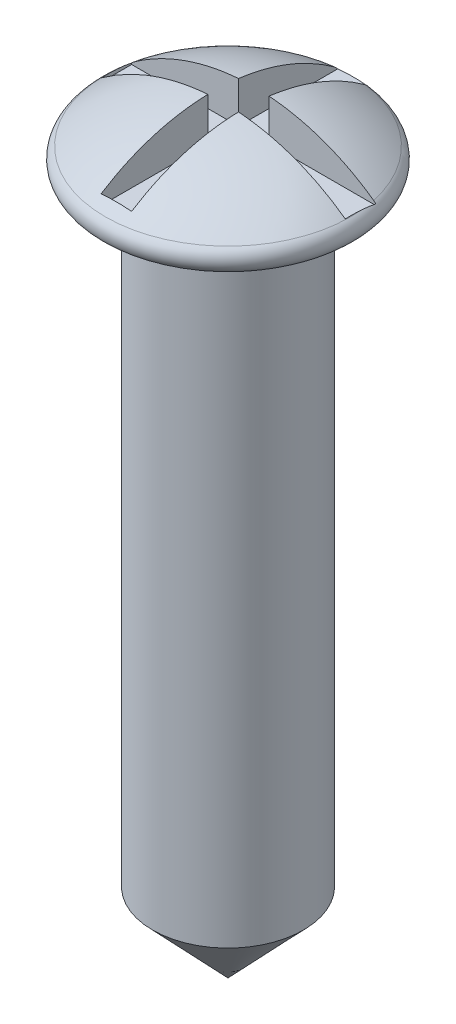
from build123d import *

# Parameters (mm, degrees)
CONG_1_R                = 0.1
ENL_V_MAT_EXTRU_1_DEPTH = 1


with BuildPart() as part:
    # Esquisse1 → R_volution1 (revolve)
    with BuildSketch(Plane.XY, mode=Mode.PRIVATE) as r_volution1_sk:
        with BuildLine():
            Line((1.1, 0), (0.55, 0))
            Line((0.55, 0), (0.55, -4.5))
            Line((0.55, -4.5), (0, -5.077656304))
            Line((0, -5.077656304), (0, 0.473544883))
            ThreePointArc((0, 0.473544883), (0.598799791, 0.350129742), (1.1, 0))
        make_face()
    revolve(r_volution1_sk.sketch.rotate(Axis((0, 3.800054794, 0), (0, -1, 0)), 90), axis=Axis((0, 3.800054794, 0), (0, -1, 0)))

    # Cong_1
    cong_1_edges = [part.edges().sort_by_distance(p)[0] for p in [
        (0, 0, -1.1),
    ]]
    fillet(cong_1_edges, radius=CONG_1_R)

    # Esquisse2 → Enl_v. mat.-Extru.1 (cut, symmetric)
    with BuildSketch(Plane(origin=(0, 1.15653742, 0), x_dir=(-1, 0, 0), z_dir=(0, 1, 0))):
        Polygon((-0.111390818, 0.814869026), (0.111390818, 0.814869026), (0.111390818, 0.035012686), (0.891247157, 0.035012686), (0.891247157, -0.187768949), (0.111390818, -0.187768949), (0.111390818, -0.967625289), (-0.111390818, -0.967625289), (-0.111390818, -0.187768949), (-0.891247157, -0.187768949), (-0.891247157, 0.035012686), (-0.111390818, 0.035012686), align=None)
    extrude(amount=ENL_V_MAT_EXTRU_1_DEPTH, both=True, mode=Mode.SUBTRACT)


solid = part.part
